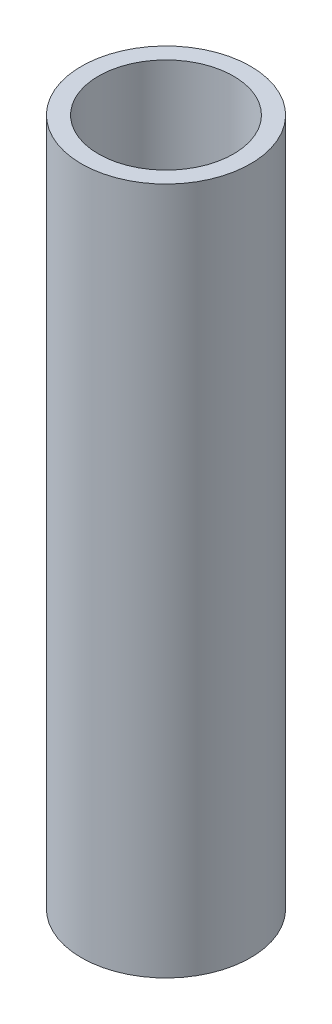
ISO-10303-21;
HEADER;
FILE_DESCRIPTION(('STEP AP214'),'2;1');
FILE_NAME('part.step','',(''),(''),'','','');
FILE_SCHEMA(('AUTOMOTIVE_DESIGN { 1 0 10303 214 1 1 1 1 }'));
ENDSEC;
DATA;
#1=APPLICATION_CONTEXT('core data for automotive mechanical design processes');
#2=APPLICATION_PROTOCOL_DEFINITION('international standard','automotive_design',2000,#1);
#3=PRODUCT_CONTEXT('',#1,'mechanical');
#4=PRODUCT('Part','Part','',(#3));
#5=PRODUCT_RELATED_PRODUCT_CATEGORY('part','',(#4));
#6=PRODUCT_DEFINITION_FORMATION('','',#4);
#7=PRODUCT_DEFINITION_CONTEXT('part definition',#1,'design');
#8=PRODUCT_DEFINITION('design','',#6,#7);
#9=PRODUCT_DEFINITION_SHAPE('','',#8);
#10=(LENGTH_UNIT() NAMED_UNIT(*) SI_UNIT(.MILLI.,.METRE.));
#11=(NAMED_UNIT(*) PLANE_ANGLE_UNIT() SI_UNIT($,.RADIAN.));
#12=(NAMED_UNIT(*) SI_UNIT($,.STERADIAN.) SOLID_ANGLE_UNIT());
#13=UNCERTAINTY_MEASURE_WITH_UNIT(LENGTH_MEASURE(1.E-05),#10,'distance_accuracy_value','');
#14=(GEOMETRIC_REPRESENTATION_CONTEXT(3) GLOBAL_UNCERTAINTY_ASSIGNED_CONTEXT((#13)) GLOBAL_UNIT_ASSIGNED_CONTEXT((#10,
#11,#12)) REPRESENTATION_CONTEXT('',''));
#15=CARTESIAN_POINT('',(0.,0.,0.));
#16=DIRECTION('',(0.,0.,1.));
#17=DIRECTION('',(1.,0.,0.));
#18=AXIS2_PLACEMENT_3D('',#15,#16,#17);
#19=CARTESIAN_POINT('',(0.,2.54,0.));
#20=DIRECTION('',(0.,-1.,0.));
#21=DIRECTION('',(0.,0.,-1.));
#22=AXIS2_PLACEMENT_3D('',#19,#20,#21);
#23=CYLINDRICAL_SURFACE('',#22,12.8097922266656);
#24=CARTESIAN_POINT('',(0.,0.,0.));
#25=DIRECTION('',(0.,1.,0.));
#26=DIRECTION('',(0.,0.,1.));
#27=AXIS2_PLACEMENT_3D('',#24,#25,#26);
#28=CIRCLE('',#27,12.8097922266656);
#29=CARTESIAN_POINT('',(0.,0.,12.8097922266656));
#30=VERTEX_POINT('',#29);
#31=EDGE_CURVE('E37',#30,#30,#28,.T.);
#32=ORIENTED_EDGE('',*,*,#31,.T.);
#33=EDGE_LOOP('',(#32));
#34=FACE_BOUND('',#33,.T.);
#35=CARTESIAN_POINT('',(0.,104.14,0.));
#36=DIRECTION('',(0.,1.,0.));
#37=DIRECTION('',(0.,0.,1.));
#38=AXIS2_PLACEMENT_3D('',#35,#36,#37);
#39=CIRCLE('',#38,12.8097922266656);
#40=CARTESIAN_POINT('',(0.,104.14,12.8097922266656));
#41=VERTEX_POINT('',#40);
#42=EDGE_CURVE('E41',#41,#41,#39,.T.);
#43=ORIENTED_EDGE('',*,*,#42,.F.);
#44=EDGE_LOOP('',(#43));
#45=FACE_BOUND('',#44,.T.);
#46=ADVANCED_FACE('F31',(#34,#45),#23,.T.);
#47=CARTESIAN_POINT('',(0.,0.,0.));
#48=DIRECTION('',(0.,1.,0.));
#49=DIRECTION('',(0.,0.,1.));
#50=AXIS2_PLACEMENT_3D('',#47,#48,#49);
#51=PLANE('',#50);
#52=ORIENTED_EDGE('',*,*,#31,.F.);
#53=EDGE_LOOP('',(#52));
#54=FACE_BOUND('',#53,.T.);
#55=ADVANCED_FACE('F55',(#54),#51,.F.);
#56=CARTESIAN_POINT('',(0.,104.14,0.));
#57=DIRECTION('',(0.,1.,0.));
#58=DIRECTION('',(0.,0.,1.));
#59=AXIS2_PLACEMENT_3D('',#56,#57,#58);
#60=PLANE('',#59);
#61=ORIENTED_EDGE('',*,*,#42,.T.);
#62=EDGE_LOOP('',(#61));
#63=FACE_BOUND('',#62,.T.);
#64=CARTESIAN_POINT('',(0.,104.14,0.));
#65=DIRECTION('',(0.,1.,0.));
#66=DIRECTION('',(0.,0.,1.));
#67=AXIS2_PLACEMENT_3D('',#64,#65,#66);
#68=CIRCLE('',#67,10.2273296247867);
#69=CARTESIAN_POINT('',(0.,104.14,10.2273296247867));
#70=VERTEX_POINT('',#69);
#71=EDGE_CURVE('E45',#70,#70,#68,.T.);
#72=ORIENTED_EDGE('',*,*,#71,.F.);
#73=EDGE_LOOP('',(#72));
#74=FACE_BOUND('',#73,.T.);
#75=ADVANCED_FACE('F53',(#63,#74),#60,.T.);
#76=CARTESIAN_POINT('',(0.,104.14,0.));
#77=DIRECTION('',(0.,-1.,0.));
#78=DIRECTION('',(0.,0.,-1.));
#79=AXIS2_PLACEMENT_3D('',#76,#77,#78);
#80=CYLINDRICAL_SURFACE('',#79,10.2273296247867);
#81=ORIENTED_EDGE('',*,*,#71,.T.);
#82=EDGE_LOOP('',(#81));
#83=FACE_BOUND('',#82,.T.);
#84=CARTESIAN_POINT('',(0.,2.54,0.));
#85=DIRECTION('',(0.,1.,0.));
#86=DIRECTION('',(0.,0.,1.));
#87=AXIS2_PLACEMENT_3D('',#84,#85,#86);
#88=CIRCLE('',#87,10.2273296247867);
#89=CARTESIAN_POINT('',(0.,2.54,10.2273296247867));
#90=VERTEX_POINT('',#89);
#91=EDGE_CURVE('E10',#90,#90,#88,.F.);
#92=ORIENTED_EDGE('',*,*,#91,.T.);
#93=EDGE_LOOP('',(#92));
#94=FACE_BOUND('',#93,.T.);
#95=ADVANCED_FACE('F51',(#83,#94),#80,.F.);
#96=CARTESIAN_POINT('',(0.,2.54,0.));
#97=DIRECTION('',(0.,1.,0.));
#98=DIRECTION('',(0.,0.,1.));
#99=AXIS2_PLACEMENT_3D('',#96,#97,#98);
#100=PLANE('',#99);
#101=ORIENTED_EDGE('',*,*,#91,.F.);
#102=EDGE_LOOP('',(#101));
#103=FACE_BOUND('',#102,.T.);
#104=ADVANCED_FACE('F62',(#103),#100,.T.);
#105=CLOSED_SHELL('',(#46,#55,#75,#95,#104));
#106=MANIFOLD_SOLID_BREP('B2',#105);
#107=ADVANCED_BREP_SHAPE_REPRESENTATION('',(#18,#106),#14);
#108=SHAPE_DEFINITION_REPRESENTATION(#9,#107);
ENDSEC;
END-ISO-10303-21;
